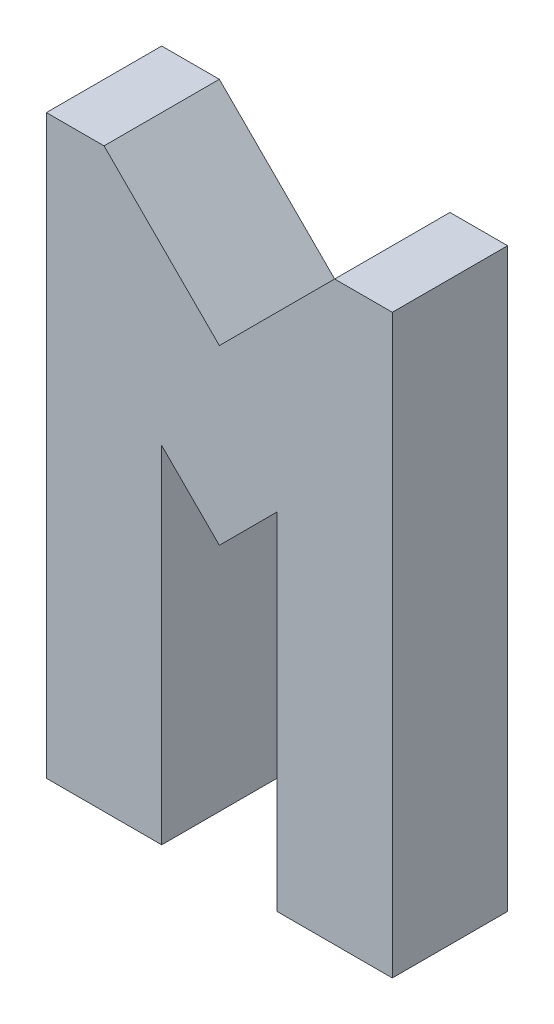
from build123d import *

# Parameters (mm, degrees)
BOSS_EXTRU_1_DEPTH = 10


with BuildPart() as part:
    # Esquisse1 → Boss.-Extru.1 (new body)
    with BuildSketch(Plane.XY):
        Polygon((20, 30), (15, 25), (10, 30), (10, 0), (0, 0), (0, 50), (5, 50), (15, 40), (25, 50), (30, 50), (30, 0), (20, 0), align=None)
    extrude(amount=BOSS_EXTRU_1_DEPTH)


solid = part.part
